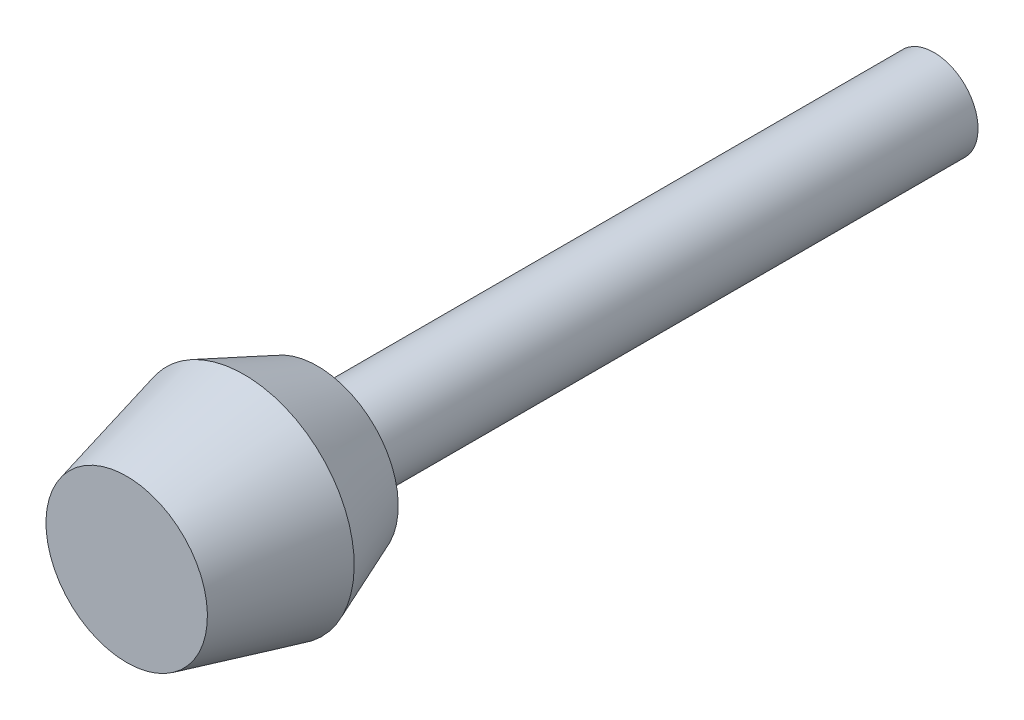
ISO-10303-21;
HEADER;
FILE_DESCRIPTION(('STEP AP214'),'2;1');
FILE_NAME('part.step','',(''),(''),'','','');
FILE_SCHEMA(('AUTOMOTIVE_DESIGN { 1 0 10303 214 1 1 1 1 }'));
ENDSEC;
DATA;
#1=APPLICATION_CONTEXT('core data for automotive mechanical design processes');
#2=APPLICATION_PROTOCOL_DEFINITION('international standard','automotive_design',2000,#1);
#3=PRODUCT_CONTEXT('',#1,'mechanical');
#4=PRODUCT('Part','Part','',(#3));
#5=PRODUCT_RELATED_PRODUCT_CATEGORY('part','',(#4));
#6=PRODUCT_DEFINITION_FORMATION('','',#4);
#7=PRODUCT_DEFINITION_CONTEXT('part definition',#1,'design');
#8=PRODUCT_DEFINITION('design','',#6,#7);
#9=PRODUCT_DEFINITION_SHAPE('','',#8);
#10=(LENGTH_UNIT() NAMED_UNIT(*) SI_UNIT(.MILLI.,.METRE.));
#11=(NAMED_UNIT(*) PLANE_ANGLE_UNIT() SI_UNIT($,.RADIAN.));
#12=(NAMED_UNIT(*) SI_UNIT($,.STERADIAN.) SOLID_ANGLE_UNIT());
#13=UNCERTAINTY_MEASURE_WITH_UNIT(LENGTH_MEASURE(1.E-05),#10,'distance_accuracy_value','');
#14=(GEOMETRIC_REPRESENTATION_CONTEXT(3) GLOBAL_UNCERTAINTY_ASSIGNED_CONTEXT((#13)) GLOBAL_UNIT_ASSIGNED_CONTEXT((#10,
#11,#12)) REPRESENTATION_CONTEXT('',''));
#15=CARTESIAN_POINT('',(0.,0.,0.));
#16=DIRECTION('',(0.,0.,1.));
#17=DIRECTION('',(1.,0.,0.));
#18=AXIS2_PLACEMENT_3D('',#15,#16,#17);
#19=CARTESIAN_POINT('',(0.,0.,0.));
#20=DIRECTION('',(0.,0.,1.));
#21=DIRECTION('',(-0.769107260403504,-0.639119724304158,0.));
#22=AXIS2_PLACEMENT_3D('',#19,#20,#21);
#23=PLANE('',#22);
#24=CARTESIAN_POINT('',(0.,0.,0.));
#25=DIRECTION('',(0.,0.,1.));
#26=DIRECTION('',(0.,-1.,0.));
#27=AXIS2_PLACEMENT_3D('',#24,#25,#26);
#28=CIRCLE('',#27,5.49999999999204);
#29=CARTESIAN_POINT('',(0.,-5.49999999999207,0.));
#30=VERTEX_POINT('',#29);
#31=EDGE_CURVE('E30',#30,#30,#28,.F.);
#32=ORIENTED_EDGE('',*,*,#31,.F.);
#33=EDGE_LOOP('',(#32));
#34=FACE_BOUND('',#33,.T.);
#35=ADVANCED_FACE('F15',(#34),#23,.T.);
#36=CARTESIAN_POINT('',(0.,0.,-7.8431502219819));
#37=DIRECTION('',(0.,0.,-1.));
#38=DIRECTION('',(0.769107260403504,0.639119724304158,0.));
#39=AXIS2_PLACEMENT_3D('',#36,#37,#38);
#40=CONICAL_SURFACE('',#39,7.46078755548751,0.244978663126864);
#41=ORIENTED_EDGE('',*,*,#31,.T.);
#42=EDGE_LOOP('',(#41));
#43=FACE_BOUND('',#42,.T.);
#44=CARTESIAN_POINT('',(0.,0.,-8.00000000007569));
#45=DIRECTION('',(0.,0.,1.));
#46=DIRECTION('',(0.,-1.,0.));
#47=AXIS2_PLACEMENT_3D('',#44,#45,#46);
#48=CIRCLE('',#47,7.50000000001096);
#49=CARTESIAN_POINT('',(0.,-7.50000000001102,-8.00000000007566));
#50=VERTEX_POINT('',#49);
#51=EDGE_CURVE('E22',#50,#50,#48,.T.);
#52=ORIENTED_EDGE('',*,*,#51,.T.);
#53=EDGE_LOOP('',(#52));
#54=FACE_BOUND('',#53,.T.);
#55=ADVANCED_FACE('F54',(#43,#54),#40,.T.);
#56=CARTESIAN_POINT('',(0.,0.,-8.1501133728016));
#57=DIRECTION('',(0.,0.,1.));
#58=DIRECTION('',(-0.769107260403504,-0.639119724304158,0.));
#59=AXIS2_PLACEMENT_3D('',#56,#57,#58);
#60=CONICAL_SURFACE('',#59,7.43995465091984,0.380506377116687);
#61=CARTESIAN_POINT('',(0.,0.,-13.));
#62=DIRECTION('',(0.,0.,1.));
#63=DIRECTION('',(0.,-1.,0.));
#64=AXIS2_PLACEMENT_3D('',#61,#62,#63);
#65=CIRCLE('',#64,5.50000000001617);
#66=CARTESIAN_POINT('',(0.,-5.50000000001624,-13.));
#67=VERTEX_POINT('',#66);
#68=EDGE_CURVE('E10',#67,#67,#65,.F.);
#69=ORIENTED_EDGE('',*,*,#68,.F.);
#70=EDGE_LOOP('',(#69));
#71=FACE_BOUND('',#70,.T.);
#72=ORIENTED_EDGE('',*,*,#51,.F.);
#73=EDGE_LOOP('',(#72));
#74=FACE_BOUND('',#73,.T.);
#75=ADVANCED_FACE('F17',(#71,#74),#60,.T.);
#76=CARTESIAN_POINT('',(0.,0.,-2.5));
#77=DIRECTION('',(0.,0.,-1.));
#78=DIRECTION('',(1.,0.,0.));
#79=AXIS2_PLACEMENT_3D('',#76,#77,#78);
#80=CYLINDRICAL_SURFACE('',#79,3.);
#81=CARTESIAN_POINT('',(0.,0.,-13.));
#82=DIRECTION('',(0.,0.,-1.));
#83=DIRECTION('',(0.769107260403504,0.639119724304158,0.));
#84=AXIS2_PLACEMENT_3D('',#81,#82,#83);
#85=CIRCLE('',#84,3.);
#86=CARTESIAN_POINT('',(2.30732178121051,1.91735917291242,-13.));
#87=VERTEX_POINT('',#86);
#88=EDGE_CURVE('E26',#87,#87,#85,.T.);
#89=ORIENTED_EDGE('',*,*,#88,.T.);
#90=EDGE_LOOP('',(#89));
#91=FACE_BOUND('',#90,.T.);
#92=CARTESIAN_POINT('',(0.,-2.22416370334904E-13,-55.));
#93=DIRECTION('',(0.,0.,-1.));
#94=DIRECTION('',(0.,1.,0.));
#95=AXIS2_PLACEMENT_3D('',#92,#93,#94);
#96=CIRCLE('',#95,3.);
#97=CARTESIAN_POINT('',(0.,2.99999999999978,-55.));
#98=VERTEX_POINT('',#97);
#99=EDGE_CURVE('E34',#98,#98,#96,.T.);
#100=ORIENTED_EDGE('',*,*,#99,.F.);
#101=EDGE_LOOP('',(#100));
#102=FACE_BOUND('',#101,.T.);
#103=ADVANCED_FACE('F41',(#91,#102),#80,.T.);
#104=CARTESIAN_POINT('',(0.,0.,-13.));
#105=DIRECTION('',(0.,0.,1.));
#106=DIRECTION('',(-0.769107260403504,-0.639119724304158,0.));
#107=AXIS2_PLACEMENT_3D('',#104,#105,#106);
#108=PLANE('',#107);
#109=ORIENTED_EDGE('',*,*,#88,.F.);
#110=EDGE_LOOP('',(#109));
#111=FACE_BOUND('',#110,.T.);
#112=ORIENTED_EDGE('',*,*,#68,.T.);
#113=EDGE_LOOP('',(#112));
#114=FACE_BOUND('',#113,.T.);
#115=ADVANCED_FACE('F43',(#111,#114),#108,.F.);
#116=CARTESIAN_POINT('',(0.,-2.22416370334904E-13,-55.));
#117=DIRECTION('',(0.,0.,-1.));
#118=DIRECTION('',(0.,1.,0.));
#119=AXIS2_PLACEMENT_3D('',#116,#117,#118);
#120=PLANE('',#119);
#121=ORIENTED_EDGE('',*,*,#99,.T.);
#122=EDGE_LOOP('',(#121));
#123=FACE_BOUND('',#122,.T.);
#124=ADVANCED_FACE('F39',(#123),#120,.T.);
#125=CLOSED_SHELL('',(#35,#55,#75,#103,#115,#124));
#126=MANIFOLD_SOLID_BREP('B1',#125);
#127=ADVANCED_BREP_SHAPE_REPRESENTATION('',(#18,#126),#14);
#128=SHAPE_DEFINITION_REPRESENTATION(#9,#127);
ENDSEC;
END-ISO-10303-21;
